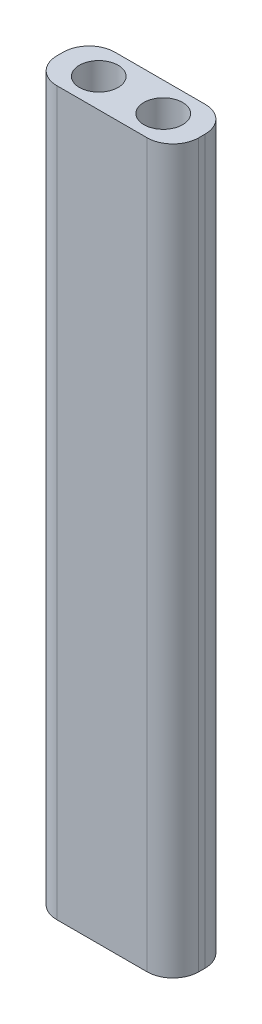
ISO-10303-21;
HEADER;
FILE_DESCRIPTION(('STEP AP214'),'2;1');
FILE_NAME('part.step','',(''),(''),'','','');
FILE_SCHEMA(('AUTOMOTIVE_DESIGN { 1 0 10303 214 1 1 1 1 }'));
ENDSEC;
DATA;
#1=APPLICATION_CONTEXT('core data for automotive mechanical design processes');
#2=APPLICATION_PROTOCOL_DEFINITION('international standard','automotive_design',2000,#1);
#3=PRODUCT_CONTEXT('',#1,'mechanical');
#4=PRODUCT('Part','Part','',(#3));
#5=PRODUCT_RELATED_PRODUCT_CATEGORY('part','',(#4));
#6=PRODUCT_DEFINITION_FORMATION('','',#4);
#7=PRODUCT_DEFINITION_CONTEXT('part definition',#1,'design');
#8=PRODUCT_DEFINITION('design','',#6,#7);
#9=PRODUCT_DEFINITION_SHAPE('','',#8);
#10=(LENGTH_UNIT() NAMED_UNIT(*) SI_UNIT(.MILLI.,.METRE.));
#11=(NAMED_UNIT(*) PLANE_ANGLE_UNIT() SI_UNIT($,.RADIAN.));
#12=(NAMED_UNIT(*) SI_UNIT($,.STERADIAN.) SOLID_ANGLE_UNIT());
#13=UNCERTAINTY_MEASURE_WITH_UNIT(LENGTH_MEASURE(1.E-05),#10,'distance_accuracy_value','');
#14=(GEOMETRIC_REPRESENTATION_CONTEXT(3) GLOBAL_UNCERTAINTY_ASSIGNED_CONTEXT((#13)) GLOBAL_UNIT_ASSIGNED_CONTEXT((#10,
#11,#12)) REPRESENTATION_CONTEXT('',''));
#15=CARTESIAN_POINT('',(0.,0.,0.));
#16=DIRECTION('',(0.,0.,1.));
#17=DIRECTION('',(1.,0.,0.));
#18=AXIS2_PLACEMENT_3D('',#15,#16,#17);
#19=CARTESIAN_POINT('',(0.,56.,2.25));
#20=DIRECTION('',(0.,0.,-1.));
#21=DIRECTION('',(-1.,0.,0.));
#22=AXIS2_PLACEMENT_3D('',#19,#20,#21);
#23=PLANE('',#22);
#24=DIRECTION('',(1.,0.,0.));
#25=VECTOR('',#24,1.);
#26=CARTESIAN_POINT('',(0.,56.,2.25));
#27=LINE('',#26,#25);
#28=CARTESIAN_POINT('',(-3.5,56.,2.25));
#29=VERTEX_POINT('',#28);
#30=CARTESIAN_POINT('',(3.5,56.,2.25));
#31=VERTEX_POINT('',#30);
#32=EDGE_CURVE('E122',#29,#31,#27,.T.);
#33=ORIENTED_EDGE('',*,*,#32,.F.);
#34=DIRECTION('',(0.,-1.,0.));
#35=VECTOR('',#34,1.);
#36=CARTESIAN_POINT('',(-3.5,0.,2.25));
#37=LINE('',#36,#35);
#38=CARTESIAN_POINT('',(-3.5,0.,2.25));
#39=VERTEX_POINT('',#38);
#40=EDGE_CURVE('E107',#29,#39,#37,.T.);
#41=ORIENTED_EDGE('',*,*,#40,.T.);
#42=DIRECTION('',(1.,0.,0.));
#43=VECTOR('',#42,1.);
#44=CARTESIAN_POINT('',(0.,0.,2.25));
#45=LINE('',#44,#43);
#46=CARTESIAN_POINT('',(3.5,0.,2.25));
#47=VERTEX_POINT('',#46);
#48=EDGE_CURVE('E119',#39,#47,#45,.T.);
#49=ORIENTED_EDGE('',*,*,#48,.T.);
#50=DIRECTION('',(0.,-1.,0.));
#51=VECTOR('',#50,1.);
#52=CARTESIAN_POINT('',(3.5,56.,2.25));
#53=LINE('',#52,#51);
#54=EDGE_CURVE('E124',#47,#31,#53,.F.);
#55=ORIENTED_EDGE('',*,*,#54,.T.);
#56=EDGE_LOOP('',(#33,#41,#49,#55));
#57=FACE_BOUND('',#56,.T.);
#58=ADVANCED_FACE('F37',(#57),#23,.F.);
#59=CARTESIAN_POINT('',(5.5,56.,0.));
#60=DIRECTION('',(-1.,0.,0.));
#61=DIRECTION('',(0.,0.,1.));
#62=AXIS2_PLACEMENT_3D('',#59,#60,#61);
#63=PLANE('',#62);
#64=DIRECTION('',(0.,0.,-1.));
#65=VECTOR('',#64,1.);
#66=CARTESIAN_POINT('',(5.5,0.,0.));
#67=LINE('',#66,#65);
#68=CARTESIAN_POINT('',(5.5,0.,0.25));
#69=VERTEX_POINT('',#68);
#70=CARTESIAN_POINT('',(5.5,0.,-0.25));
#71=VERTEX_POINT('',#70);
#72=EDGE_CURVE('E129',#69,#71,#67,.T.);
#73=ORIENTED_EDGE('',*,*,#72,.T.);
#74=DIRECTION('',(0.,-1.,0.));
#75=VECTOR('',#74,1.);
#76=CARTESIAN_POINT('',(5.5,56.,-0.25));
#77=LINE('',#76,#75);
#78=CARTESIAN_POINT('',(5.5,56.,-0.25));
#79=VERTEX_POINT('',#78);
#80=EDGE_CURVE('E11',#71,#79,#77,.F.);
#81=ORIENTED_EDGE('',*,*,#80,.T.);
#82=DIRECTION('',(0.,0.,-1.));
#83=VECTOR('',#82,1.);
#84=CARTESIAN_POINT('',(5.5,56.,0.));
#85=LINE('',#84,#83);
#86=CARTESIAN_POINT('',(5.5,56.,0.25));
#87=VERTEX_POINT('',#86);
#88=EDGE_CURVE('E172',#87,#79,#85,.T.);
#89=ORIENTED_EDGE('',*,*,#88,.F.);
#90=DIRECTION('',(0.,-1.,0.));
#91=VECTOR('',#90,1.);
#92=CARTESIAN_POINT('',(5.5,56.,0.25));
#93=LINE('',#92,#91);
#94=EDGE_CURVE('E45',#87,#69,#93,.T.);
#95=ORIENTED_EDGE('',*,*,#94,.T.);
#96=EDGE_LOOP('',(#73,#81,#89,#95));
#97=FACE_BOUND('',#96,.T.);
#98=ADVANCED_FACE('F170',(#97),#63,.F.);
#99=CARTESIAN_POINT('',(0.,56.,-2.25));
#100=DIRECTION('',(0.,0.,-1.));
#101=DIRECTION('',(-1.,0.,0.));
#102=AXIS2_PLACEMENT_3D('',#99,#100,#101);
#103=PLANE('',#102);
#104=DIRECTION('',(1.,0.,0.));
#105=VECTOR('',#104,1.);
#106=CARTESIAN_POINT('',(0.,0.,-2.25));
#107=LINE('',#106,#105);
#108=CARTESIAN_POINT('',(-3.5,0.,-2.25));
#109=VERTEX_POINT('',#108);
#110=CARTESIAN_POINT('',(3.5,0.,-2.25));
#111=VERTEX_POINT('',#110);
#112=EDGE_CURVE('E132',#109,#111,#107,.T.);
#113=ORIENTED_EDGE('',*,*,#112,.F.);
#114=DIRECTION('',(0.,-1.,0.));
#115=VECTOR('',#114,1.);
#116=CARTESIAN_POINT('',(-3.5,56.,-2.25));
#117=LINE('',#116,#115);
#118=CARTESIAN_POINT('',(-3.5,56.,-2.25));
#119=VERTEX_POINT('',#118);
#120=EDGE_CURVE('E59',#109,#119,#117,.F.);
#121=ORIENTED_EDGE('',*,*,#120,.T.);
#122=DIRECTION('',(1.,0.,0.));
#123=VECTOR('',#122,1.);
#124=CARTESIAN_POINT('',(0.,56.,-2.25));
#125=LINE('',#124,#123);
#126=CARTESIAN_POINT('',(3.5,56.,-2.25));
#127=VERTEX_POINT('',#126);
#128=EDGE_CURVE('E179',#119,#127,#125,.T.);
#129=ORIENTED_EDGE('',*,*,#128,.T.);
#130=DIRECTION('',(0.,-1.,0.));
#131=VECTOR('',#130,1.);
#132=CARTESIAN_POINT('',(3.5,0.,-2.25));
#133=LINE('',#132,#131);
#134=EDGE_CURVE('E163',#127,#111,#133,.T.);
#135=ORIENTED_EDGE('',*,*,#134,.T.);
#136=EDGE_LOOP('',(#113,#121,#129,#135));
#137=FACE_BOUND('',#136,.T.);
#138=ADVANCED_FACE('F178',(#137),#103,.T.);
#139=CARTESIAN_POINT('',(-2.5,56.,0.));
#140=DIRECTION('',(0.,-1.,0.));
#141=DIRECTION('',(0.,0.,-1.));
#142=AXIS2_PLACEMENT_3D('',#139,#140,#141);
#143=CYLINDRICAL_SURFACE('',#142,1.5);
#144=CARTESIAN_POINT('',(-2.5,56.,0.));
#145=DIRECTION('',(0.,1.,0.));
#146=DIRECTION('',(0.,0.,1.));
#147=AXIS2_PLACEMENT_3D('',#144,#145,#146);
#148=CIRCLE('',#147,1.5);
#149=CARTESIAN_POINT('',(-2.5,56.,1.5));
#150=VERTEX_POINT('',#149);
#151=EDGE_CURVE('E184',#150,#150,#148,.T.);
#152=ORIENTED_EDGE('',*,*,#151,.T.);
#153=EDGE_LOOP('',(#152));
#154=FACE_BOUND('',#153,.T.);
#155=CARTESIAN_POINT('',(-2.5,0.,0.));
#156=DIRECTION('',(0.,1.,0.));
#157=DIRECTION('',(0.,0.,1.));
#158=AXIS2_PLACEMENT_3D('',#155,#156,#157);
#159=CIRCLE('',#158,1.5);
#160=CARTESIAN_POINT('',(-2.5,0.,1.5));
#161=VERTEX_POINT('',#160);
#162=EDGE_CURVE('E142',#161,#161,#159,.T.);
#163=ORIENTED_EDGE('',*,*,#162,.F.);
#164=EDGE_LOOP('',(#163));
#165=FACE_BOUND('',#164,.T.);
#166=ADVANCED_FACE('F233',(#154,#165),#143,.F.);
#167=CARTESIAN_POINT('',(-5.5,56.,0.));
#168=DIRECTION('',(-1.,0.,0.));
#169=DIRECTION('',(0.,0.,1.));
#170=AXIS2_PLACEMENT_3D('',#167,#168,#169);
#171=PLANE('',#170);
#172=DIRECTION('',(0.,0.,-1.));
#173=VECTOR('',#172,1.);
#174=CARTESIAN_POINT('',(-5.5,0.,0.));
#175=LINE('',#174,#173);
#176=CARTESIAN_POINT('',(-5.5,0.,0.25));
#177=VERTEX_POINT('',#176);
#178=CARTESIAN_POINT('',(-5.5,0.,-0.25));
#179=VERTEX_POINT('',#178);
#180=EDGE_CURVE('E140',#177,#179,#175,.T.);
#181=ORIENTED_EDGE('',*,*,#180,.F.);
#182=DIRECTION('',(0.,-1.,0.));
#183=VECTOR('',#182,1.);
#184=CARTESIAN_POINT('',(-5.5,56.,0.25));
#185=LINE('',#184,#183);
#186=CARTESIAN_POINT('',(-5.5,56.,0.25));
#187=VERTEX_POINT('',#186);
#188=EDGE_CURVE('E108',#177,#187,#185,.F.);
#189=ORIENTED_EDGE('',*,*,#188,.T.);
#190=DIRECTION('',(0.,0.,-1.));
#191=VECTOR('',#190,1.);
#192=CARTESIAN_POINT('',(-5.5,56.,0.));
#193=LINE('',#192,#191);
#194=CARTESIAN_POINT('',(-5.5,56.,-0.25));
#195=VERTEX_POINT('',#194);
#196=EDGE_CURVE('E181',#187,#195,#193,.T.);
#197=ORIENTED_EDGE('',*,*,#196,.T.);
#198=DIRECTION('',(0.,-1.,0.));
#199=VECTOR('',#198,1.);
#200=CARTESIAN_POINT('',(-5.5,56.,-0.25));
#201=LINE('',#200,#199);
#202=EDGE_CURVE('E113',#195,#179,#201,.T.);
#203=ORIENTED_EDGE('',*,*,#202,.T.);
#204=EDGE_LOOP('',(#181,#189,#197,#203));
#205=FACE_BOUND('',#204,.T.);
#206=ADVANCED_FACE('F199',(#205),#171,.T.);
#207=CARTESIAN_POINT('',(2.5,56.,0.));
#208=DIRECTION('',(0.,-1.,0.));
#209=DIRECTION('',(0.,0.,-1.));
#210=AXIS2_PLACEMENT_3D('',#207,#208,#209);
#211=CYLINDRICAL_SURFACE('',#210,1.5);
#212=CARTESIAN_POINT('',(2.5,56.,0.));
#213=DIRECTION('',(0.,1.,0.));
#214=DIRECTION('',(0.,0.,1.));
#215=AXIS2_PLACEMENT_3D('',#212,#213,#214);
#216=CIRCLE('',#215,1.5);
#217=CARTESIAN_POINT('',(2.5,56.,1.5));
#218=VERTEX_POINT('',#217);
#219=EDGE_CURVE('E135',#218,#218,#216,.F.);
#220=ORIENTED_EDGE('',*,*,#219,.F.);
#221=EDGE_LOOP('',(#220));
#222=FACE_BOUND('',#221,.T.);
#223=CARTESIAN_POINT('',(2.5,0.,0.));
#224=DIRECTION('',(0.,1.,0.));
#225=DIRECTION('',(0.,0.,1.));
#226=AXIS2_PLACEMENT_3D('',#223,#224,#225);
#227=CIRCLE('',#226,1.5);
#228=CARTESIAN_POINT('',(2.5,0.,1.5));
#229=VERTEX_POINT('',#228);
#230=EDGE_CURVE('E145',#229,#229,#227,.F.);
#231=ORIENTED_EDGE('',*,*,#230,.T.);
#232=EDGE_LOOP('',(#231));
#233=FACE_BOUND('',#232,.T.);
#234=ADVANCED_FACE('F196',(#222,#233),#211,.F.);
#235=CARTESIAN_POINT('',(0.,56.,0.));
#236=DIRECTION('',(0.,1.,0.));
#237=DIRECTION('',(0.,0.,1.));
#238=AXIS2_PLACEMENT_3D('',#235,#236,#237);
#239=PLANE('',#238);
#240=ORIENTED_EDGE('',*,*,#196,.F.);
#241=CARTESIAN_POINT('',(-3.5,56.,0.25));
#242=DIRECTION('',(0.,1.,0.));
#243=DIRECTION('',(0.,0.,1.));
#244=AXIS2_PLACEMENT_3D('',#241,#242,#243);
#245=CIRCLE('',#244,2.);
#246=EDGE_CURVE('E161',#187,#29,#245,.T.);
#247=ORIENTED_EDGE('',*,*,#246,.T.);
#248=ORIENTED_EDGE('',*,*,#32,.T.);
#249=CARTESIAN_POINT('',(3.5,56.,0.25));
#250=DIRECTION('',(0.,1.,0.));
#251=DIRECTION('',(0.,0.,1.));
#252=AXIS2_PLACEMENT_3D('',#249,#250,#251);
#253=CIRCLE('',#252,2.);
#254=EDGE_CURVE('E156',#31,#87,#253,.T.);
#255=ORIENTED_EDGE('',*,*,#254,.T.);
#256=ORIENTED_EDGE('',*,*,#88,.T.);
#257=CARTESIAN_POINT('',(3.5,56.,-0.25));
#258=DIRECTION('',(0.,1.,0.));
#259=DIRECTION('',(0.,0.,1.));
#260=AXIS2_PLACEMENT_3D('',#257,#258,#259);
#261=CIRCLE('',#260,2.);
#262=EDGE_CURVE('E52',#79,#127,#261,.T.);
#263=ORIENTED_EDGE('',*,*,#262,.T.);
#264=ORIENTED_EDGE('',*,*,#128,.F.);
#265=CARTESIAN_POINT('',(-3.5,56.,-0.25));
#266=DIRECTION('',(0.,1.,0.));
#267=DIRECTION('',(0.,0.,1.));
#268=AXIS2_PLACEMENT_3D('',#265,#266,#267);
#269=CIRCLE('',#268,2.);
#270=EDGE_CURVE('E159',#119,#195,#269,.T.);
#271=ORIENTED_EDGE('',*,*,#270,.T.);
#272=EDGE_LOOP('',(#240,#247,#248,#255,#256,#263,#264,#271));
#273=FACE_BOUND('',#272,.T.);
#274=ORIENTED_EDGE('',*,*,#151,.F.);
#275=EDGE_LOOP('',(#274));
#276=FACE_BOUND('',#275,.T.);
#277=ORIENTED_EDGE('',*,*,#219,.T.);
#278=EDGE_LOOP('',(#277));
#279=FACE_BOUND('',#278,.T.);
#280=ADVANCED_FACE('F194',(#273,#276,#279),#239,.T.);
#281=CARTESIAN_POINT('',(0.,0.,0.));
#282=DIRECTION('',(0.,1.,0.));
#283=DIRECTION('',(0.,0.,1.));
#284=AXIS2_PLACEMENT_3D('',#281,#282,#283);
#285=PLANE('',#284);
#286=ORIENTED_EDGE('',*,*,#48,.F.);
#287=CARTESIAN_POINT('',(-3.5,0.,0.25));
#288=DIRECTION('',(0.,1.,0.));
#289=DIRECTION('',(0.,0.,1.));
#290=AXIS2_PLACEMENT_3D('',#287,#288,#289);
#291=CIRCLE('',#290,2.);
#292=EDGE_CURVE('E103',#39,#177,#291,.F.);
#293=ORIENTED_EDGE('',*,*,#292,.T.);
#294=ORIENTED_EDGE('',*,*,#180,.T.);
#295=CARTESIAN_POINT('',(-3.5,0.,-0.25));
#296=DIRECTION('',(0.,1.,0.));
#297=DIRECTION('',(0.,0.,1.));
#298=AXIS2_PLACEMENT_3D('',#295,#296,#297);
#299=CIRCLE('',#298,2.);
#300=EDGE_CURVE('E114',#179,#109,#299,.F.);
#301=ORIENTED_EDGE('',*,*,#300,.T.);
#302=ORIENTED_EDGE('',*,*,#112,.T.);
#303=CARTESIAN_POINT('',(3.5,0.,-0.25));
#304=DIRECTION('',(0.,1.,0.));
#305=DIRECTION('',(0.,0.,1.));
#306=AXIS2_PLACEMENT_3D('',#303,#304,#305);
#307=CIRCLE('',#306,2.);
#308=EDGE_CURVE('E150',#111,#71,#307,.F.);
#309=ORIENTED_EDGE('',*,*,#308,.T.);
#310=ORIENTED_EDGE('',*,*,#72,.F.);
#311=CARTESIAN_POINT('',(3.5,0.,0.25));
#312=DIRECTION('',(0.,1.,0.));
#313=DIRECTION('',(0.,0.,1.));
#314=AXIS2_PLACEMENT_3D('',#311,#312,#313);
#315=CIRCLE('',#314,2.);
#316=EDGE_CURVE('E123',#69,#47,#315,.F.);
#317=ORIENTED_EDGE('',*,*,#316,.T.);
#318=EDGE_LOOP('',(#286,#293,#294,#301,#302,#309,#310,#317));
#319=FACE_BOUND('',#318,.T.);
#320=ORIENTED_EDGE('',*,*,#162,.T.);
#321=EDGE_LOOP('',(#320));
#322=FACE_BOUND('',#321,.T.);
#323=ORIENTED_EDGE('',*,*,#230,.F.);
#324=EDGE_LOOP('',(#323));
#325=FACE_BOUND('',#324,.T.);
#326=ADVANCED_FACE('F126',(#319,#322,#325),#285,.F.);
#327=CARTESIAN_POINT('',(-3.5,56.,0.25));
#328=DIRECTION('',(0.,1.,0.));
#329=DIRECTION('',(0.,0.,1.));
#330=AXIS2_PLACEMENT_3D('',#327,#328,#329);
#331=CYLINDRICAL_SURFACE('',#330,2.);
#332=ORIENTED_EDGE('',*,*,#246,.F.);
#333=ORIENTED_EDGE('',*,*,#188,.F.);
#334=ORIENTED_EDGE('',*,*,#292,.F.);
#335=ORIENTED_EDGE('',*,*,#40,.F.);
#336=EDGE_LOOP('',(#332,#333,#334,#335));
#337=FACE_BOUND('',#336,.T.);
#338=ADVANCED_FACE('F106',(#337),#331,.T.);
#339=CARTESIAN_POINT('',(-3.5,56.,-0.25));
#340=DIRECTION('',(0.,-1.,0.));
#341=DIRECTION('',(0.,0.,-1.));
#342=AXIS2_PLACEMENT_3D('',#339,#340,#341);
#343=CYLINDRICAL_SURFACE('',#342,2.);
#344=ORIENTED_EDGE('',*,*,#270,.F.);
#345=ORIENTED_EDGE('',*,*,#120,.F.);
#346=ORIENTED_EDGE('',*,*,#300,.F.);
#347=ORIENTED_EDGE('',*,*,#202,.F.);
#348=EDGE_LOOP('',(#344,#345,#346,#347));
#349=FACE_BOUND('',#348,.T.);
#350=ADVANCED_FACE('F209',(#349),#343,.T.);
#351=CARTESIAN_POINT('',(3.5,56.,-0.25));
#352=DIRECTION('',(0.,1.,0.));
#353=DIRECTION('',(0.,0.,1.));
#354=AXIS2_PLACEMENT_3D('',#351,#352,#353);
#355=CYLINDRICAL_SURFACE('',#354,2.);
#356=ORIENTED_EDGE('',*,*,#262,.F.);
#357=ORIENTED_EDGE('',*,*,#80,.F.);
#358=ORIENTED_EDGE('',*,*,#308,.F.);
#359=ORIENTED_EDGE('',*,*,#134,.F.);
#360=EDGE_LOOP('',(#356,#357,#358,#359));
#361=FACE_BOUND('',#360,.T.);
#362=ADVANCED_FACE('F177',(#361),#355,.T.);
#363=CARTESIAN_POINT('',(3.5,56.,0.25));
#364=DIRECTION('',(0.,-1.,0.));
#365=DIRECTION('',(0.,0.,-1.));
#366=AXIS2_PLACEMENT_3D('',#363,#364,#365);
#367=CYLINDRICAL_SURFACE('',#366,2.);
#368=ORIENTED_EDGE('',*,*,#254,.F.);
#369=ORIENTED_EDGE('',*,*,#54,.F.);
#370=ORIENTED_EDGE('',*,*,#316,.F.);
#371=ORIENTED_EDGE('',*,*,#94,.F.);
#372=EDGE_LOOP('',(#368,#369,#370,#371));
#373=FACE_BOUND('',#372,.T.);
#374=ADVANCED_FACE('F39',(#373),#367,.T.);
#375=CLOSED_SHELL('',(#58,#98,#138,#166,#206,#234,#280,#326,#338,#350,#362,#374));
#376=MANIFOLD_SOLID_BREP('B2',#375);
#377=ADVANCED_BREP_SHAPE_REPRESENTATION('',(#18,#376),#14);
#378=SHAPE_DEFINITION_REPRESENTATION(#9,#377);
ENDSEC;
END-ISO-10303-21;
